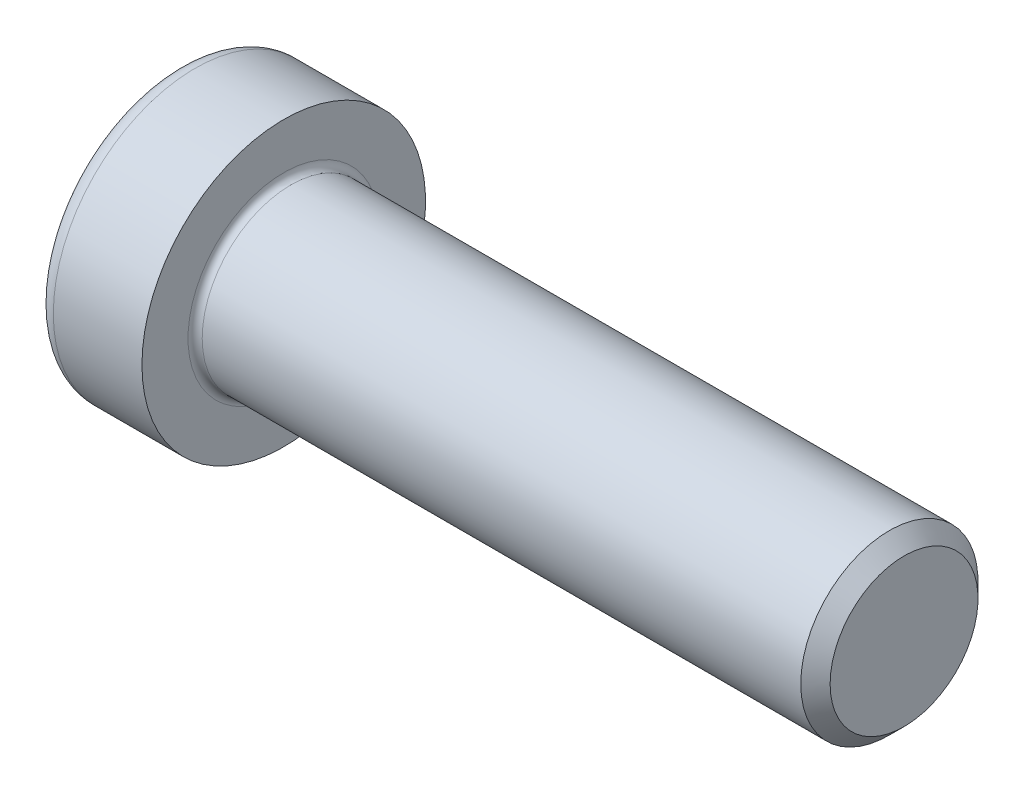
ISO-10303-21;
HEADER;
FILE_DESCRIPTION(('STEP AP214'),'2;1');
FILE_NAME('part.step','',(''),(''),'','','');
FILE_SCHEMA(('AUTOMOTIVE_DESIGN { 1 0 10303 214 1 1 1 1 }'));
ENDSEC;
DATA;
#1=APPLICATION_CONTEXT('core data for automotive mechanical design processes');
#2=APPLICATION_PROTOCOL_DEFINITION('international standard','automotive_design',2000,#1);
#3=PRODUCT_CONTEXT('',#1,'mechanical');
#4=PRODUCT('Part','Part','',(#3));
#5=PRODUCT_RELATED_PRODUCT_CATEGORY('part','',(#4));
#6=PRODUCT_DEFINITION_FORMATION('','',#4);
#7=PRODUCT_DEFINITION_CONTEXT('part definition',#1,'design');
#8=PRODUCT_DEFINITION('design','',#6,#7);
#9=PRODUCT_DEFINITION_SHAPE('','',#8);
#10=(LENGTH_UNIT() NAMED_UNIT(*) SI_UNIT(.MILLI.,.METRE.));
#11=(NAMED_UNIT(*) PLANE_ANGLE_UNIT() SI_UNIT($,.RADIAN.));
#12=(NAMED_UNIT(*) SI_UNIT($,.STERADIAN.) SOLID_ANGLE_UNIT());
#13=UNCERTAINTY_MEASURE_WITH_UNIT(LENGTH_MEASURE(1.E-05),#10,'distance_accuracy_value','');
#14=(GEOMETRIC_REPRESENTATION_CONTEXT(3) GLOBAL_UNCERTAINTY_ASSIGNED_CONTEXT((#13)) GLOBAL_UNIT_ASSIGNED_CONTEXT((#10,
#11,#12)) REPRESENTATION_CONTEXT('',''));
#15=CARTESIAN_POINT('',(0.,0.,0.));
#16=DIRECTION('',(0.,0.,1.));
#17=DIRECTION('',(1.,0.,0.));
#18=AXIS2_PLACEMENT_3D('',#15,#16,#17);
#19=CARTESIAN_POINT('',(0.,0.,0.));
#20=DIRECTION('',(-1.,0.,0.));
#21=DIRECTION('',(0.,0.,1.));
#22=AXIS2_PLACEMENT_3D('',#19,#20,#21);
#23=PLANE('',#22);
#24=DIRECTION('',(0.,-0.499999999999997,0.86602540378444));
#25=VECTOR('',#24,1.);
#26=CARTESIAN_POINT('',(0.,4.04145188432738,0.));
#27=LINE('',#26,#25);
#28=CARTESIAN_POINT('',(0.,4.04145188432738,0.));
#29=VERTEX_POINT('',#28);
#30=CARTESIAN_POINT('',(0.,2.0207259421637,3.49999999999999));
#31=VERTEX_POINT('',#30);
#32=EDGE_CURVE('E257',#29,#31,#27,.T.);
#33=ORIENTED_EDGE('',*,*,#32,.T.);
#34=DIRECTION('',(0.,1.,0.));
#35=VECTOR('',#34,1.);
#36=CARTESIAN_POINT('',(0.,-2.02072594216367,3.5));
#37=LINE('',#36,#35);
#38=CARTESIAN_POINT('',(0.,-2.02072594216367,3.5));
#39=VERTEX_POINT('',#38);
#40=EDGE_CURVE('E129',#39,#31,#37,.T.);
#41=ORIENTED_EDGE('',*,*,#40,.F.);
#42=DIRECTION('',(0.,-0.500000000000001,-0.866025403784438));
#43=VECTOR('',#42,1.);
#44=CARTESIAN_POINT('',(0.,-2.02072594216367,3.5));
#45=LINE('',#44,#43);
#46=CARTESIAN_POINT('',(0.,-4.04145188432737,0.));
#47=VERTEX_POINT('',#46);
#48=EDGE_CURVE('E260',#39,#47,#45,.T.);
#49=ORIENTED_EDGE('',*,*,#48,.T.);
#50=DIRECTION('',(0.,0.499999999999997,-0.86602540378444));
#51=VECTOR('',#50,1.);
#52=CARTESIAN_POINT('',(0.,-4.04145188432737,0.));
#53=LINE('',#52,#51);
#54=CARTESIAN_POINT('',(0.,-2.02072594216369,-3.5));
#55=VERTEX_POINT('',#54);
#56=EDGE_CURVE('E263',#47,#55,#53,.T.);
#57=ORIENTED_EDGE('',*,*,#56,.T.);
#58=DIRECTION('',(0.,-1.,0.));
#59=VECTOR('',#58,1.);
#60=CARTESIAN_POINT('',(0.,2.02072594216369,-3.50000000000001));
#61=LINE('',#60,#59);
#62=CARTESIAN_POINT('',(0.,2.02072594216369,-3.50000000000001));
#63=VERTEX_POINT('',#62);
#64=EDGE_CURVE('E266',#63,#55,#61,.T.);
#65=ORIENTED_EDGE('',*,*,#64,.F.);
#66=DIRECTION('',(0.,-0.500000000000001,-0.866025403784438));
#67=VECTOR('',#66,1.);
#68=CARTESIAN_POINT('',(0.,4.04145188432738,0.));
#69=LINE('',#68,#67);
#70=EDGE_CURVE('E124',#29,#63,#69,.T.);
#71=ORIENTED_EDGE('',*,*,#70,.F.);
#72=EDGE_LOOP('',(#33,#41,#49,#57,#65,#71));
#73=FACE_BOUND('',#72,.T.);
#74=CARTESIAN_POINT('',(0.,0.,0.));
#75=DIRECTION('',(-1.,0.,0.));
#76=DIRECTION('',(0.,0.,1.));
#77=AXIS2_PLACEMENT_3D('',#74,#75,#76);
#78=CIRCLE('',#77,7.);
#79=CARTESIAN_POINT('',(0.,0.,7.));
#80=VERTEX_POINT('',#79);
#81=EDGE_CURVE('E41',#80,#80,#78,.T.);
#82=ORIENTED_EDGE('',*,*,#81,.T.);
#83=EDGE_LOOP('',(#82));
#84=FACE_BOUND('',#83,.T.);
#85=ADVANCED_FACE('F33',(#73,#84),#23,.T.);
#86=CARTESIAN_POINT('',(-31.75,0.,0.));
#87=DIRECTION('',(-1.,0.,0.));
#88=DIRECTION('',(0.,0.,1.));
#89=AXIS2_PLACEMENT_3D('',#86,#87,#88);
#90=CYLINDRICAL_SURFACE('',#89,8.);
#91=CARTESIAN_POINT('',(1.,0.,0.));
#92=DIRECTION('',(-1.,0.,0.));
#93=DIRECTION('',(0.,0.,1.));
#94=AXIS2_PLACEMENT_3D('',#91,#92,#93);
#95=CIRCLE('',#94,8.);
#96=CARTESIAN_POINT('',(1.,0.,8.));
#97=VERTEX_POINT('',#96);
#98=EDGE_CURVE('E11',#97,#97,#95,.F.);
#99=ORIENTED_EDGE('',*,*,#98,.T.);
#100=EDGE_LOOP('',(#99));
#101=FACE_BOUND('',#100,.T.);
#102=CARTESIAN_POINT('',(6.,0.,0.));
#103=DIRECTION('',(-1.,0.,0.));
#104=DIRECTION('',(0.,0.,1.));
#105=AXIS2_PLACEMENT_3D('',#102,#103,#104);
#106=CIRCLE('',#105,8.);
#107=CARTESIAN_POINT('',(6.,0.,8.));
#108=VERTEX_POINT('',#107);
#109=EDGE_CURVE('E147',#108,#108,#106,.T.);
#110=ORIENTED_EDGE('',*,*,#109,.T.);
#111=EDGE_LOOP('',(#110));
#112=FACE_BOUND('',#111,.T.);
#113=ADVANCED_FACE('F171',(#101,#112),#90,.T.);
#114=CARTESIAN_POINT('',(6.,8.,0.));
#115=DIRECTION('',(1.,0.,0.));
#116=DIRECTION('',(0.,0.,-1.));
#117=AXIS2_PLACEMENT_3D('',#114,#115,#116);
#118=PLANE('',#117);
#119=CARTESIAN_POINT('',(6.,0.,0.));
#120=DIRECTION('',(1.,0.,0.));
#121=DIRECTION('',(0.,0.,-1.));
#122=AXIS2_PLACEMENT_3D('',#119,#120,#121);
#123=CIRCLE('',#122,5.4);
#124=CARTESIAN_POINT('',(6.,0.,-5.4));
#125=VERTEX_POINT('',#124);
#126=EDGE_CURVE('E150',#125,#125,#123,.F.);
#127=ORIENTED_EDGE('',*,*,#126,.T.);
#128=EDGE_LOOP('',(#127));
#129=FACE_BOUND('',#128,.T.);
#130=ORIENTED_EDGE('',*,*,#109,.F.);
#131=EDGE_LOOP('',(#130));
#132=FACE_BOUND('',#131,.T.);
#133=ADVANCED_FACE('F177',(#129,#132),#118,.T.);
#134=CARTESIAN_POINT('',(-31.75,0.,0.));
#135=DIRECTION('',(-1.,0.,0.));
#136=DIRECTION('',(0.,0.,1.));
#137=AXIS2_PLACEMENT_3D('',#134,#135,#136);
#138=CYLINDRICAL_SURFACE('',#137,5.);
#139=CARTESIAN_POINT('',(6.4,0.,0.));
#140=DIRECTION('',(1.,0.,0.));
#141=DIRECTION('',(0.,0.,-1.));
#142=AXIS2_PLACEMENT_3D('',#139,#140,#141);
#143=CIRCLE('',#142,5.);
#144=CARTESIAN_POINT('',(6.4,0.,-5.));
#145=VERTEX_POINT('',#144);
#146=EDGE_CURVE('E153',#145,#145,#143,.T.);
#147=ORIENTED_EDGE('',*,*,#146,.T.);
#148=EDGE_LOOP('',(#147));
#149=FACE_BOUND('',#148,.T.);
#150=CARTESIAN_POINT('',(40.1719999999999,0.,0.));
#151=DIRECTION('',(-1.,0.,0.));
#152=DIRECTION('',(0.,0.,1.));
#153=AXIS2_PLACEMENT_3D('',#150,#151,#152);
#154=CIRCLE('',#153,5.);
#155=CARTESIAN_POINT('',(40.1719999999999,0.,5.));
#156=VERTEX_POINT('',#155);
#157=EDGE_CURVE('E144',#156,#156,#154,.T.);
#158=ORIENTED_EDGE('',*,*,#157,.T.);
#159=EDGE_LOOP('',(#158));
#160=FACE_BOUND('',#159,.T.);
#161=ADVANCED_FACE('F183',(#149,#160),#138,.T.);
#162=CARTESIAN_POINT('',(41.,0.,0.));
#163=DIRECTION('',(-1.,0.,0.));
#164=DIRECTION('',(0.,0.,1.));
#165=AXIS2_PLACEMENT_3D('',#162,#163,#164);
#166=CONICAL_SURFACE('',#165,4.172,0.785398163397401);
#167=ORIENTED_EDGE('',*,*,#157,.F.);
#168=EDGE_LOOP('',(#167));
#169=FACE_BOUND('',#168,.T.);
#170=CARTESIAN_POINT('',(41.,0.,0.));
#171=DIRECTION('',(-1.,0.,0.));
#172=DIRECTION('',(0.,0.,1.));
#173=AXIS2_PLACEMENT_3D('',#170,#171,#172);
#174=CIRCLE('',#173,4.172);
#175=CARTESIAN_POINT('',(41.,0.,4.172));
#176=VERTEX_POINT('',#175);
#177=EDGE_CURVE('E140',#176,#176,#174,.T.);
#178=ORIENTED_EDGE('',*,*,#177,.T.);
#179=EDGE_LOOP('',(#178));
#180=FACE_BOUND('',#179,.T.);
#181=ADVANCED_FACE('F187',(#169,#180),#166,.T.);
#182=CARTESIAN_POINT('',(41.,4.172,0.));
#183=DIRECTION('',(1.,0.,0.));
#184=DIRECTION('',(0.,0.,-1.));
#185=AXIS2_PLACEMENT_3D('',#182,#183,#184);
#186=PLANE('',#185);
#187=ORIENTED_EDGE('',*,*,#177,.F.);
#188=EDGE_LOOP('',(#187));
#189=FACE_BOUND('',#188,.T.);
#190=ADVANCED_FACE('F167',(#189),#186,.T.);
#191=CARTESIAN_POINT('',(6.4,0.,0.));
#192=DIRECTION('',(1.,0.,0.));
#193=DIRECTION('',(0.,0.,-1.));
#194=AXIS2_PLACEMENT_3D('',#191,#192,#193);
#195=TOROIDAL_SURFACE('',#194,5.4,0.4);
#196=ORIENTED_EDGE('',*,*,#146,.F.);
#197=EDGE_LOOP('',(#196));
#198=FACE_BOUND('',#197,.T.);
#199=ORIENTED_EDGE('',*,*,#126,.F.);
#200=EDGE_LOOP('',(#199));
#201=FACE_BOUND('',#200,.T.);
#202=ADVANCED_FACE('F160',(#198,#201),#195,.F.);
#203=CARTESIAN_POINT('',(1.,0.,0.));
#204=DIRECTION('',(-1.,0.,0.));
#205=DIRECTION('',(0.,0.,1.));
#206=AXIS2_PLACEMENT_3D('',#203,#204,#205);
#207=TOROIDAL_SURFACE('',#206,7.,1.);
#208=ORIENTED_EDGE('',*,*,#98,.F.);
#209=EDGE_LOOP('',(#208));
#210=FACE_BOUND('',#209,.T.);
#211=ORIENTED_EDGE('',*,*,#81,.F.);
#212=EDGE_LOOP('',(#211));
#213=FACE_BOUND('',#212,.T.);
#214=ADVANCED_FACE('F35',(#210,#213),#207,.T.);
#215=CARTESIAN_POINT('',(4.5,4.04145188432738,0.));
#216=DIRECTION('',(0.,-0.86602540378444,-0.499999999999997));
#217=DIRECTION('',(0.,0.499999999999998,-0.86602540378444));
#218=AXIS2_PLACEMENT_3D('',#215,#216,#217);
#219=PLANE('',#218);
#220=ORIENTED_EDGE('',*,*,#32,.F.);
#221=DIRECTION('',(-1.,0.,0.));
#222=VECTOR('',#221,1.);
#223=CARTESIAN_POINT('',(4.5,4.04145188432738,0.));
#224=LINE('',#223,#222);
#225=CARTESIAN_POINT('',(4.5,4.04145188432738,0.));
#226=VERTEX_POINT('',#225);
#227=EDGE_CURVE('E247',#226,#29,#224,.T.);
#228=ORIENTED_EDGE('',*,*,#227,.F.);
#229=DIRECTION('',(0.,-0.499999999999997,0.86602540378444));
#230=VECTOR('',#229,1.);
#231=CARTESIAN_POINT('',(4.5,4.04145188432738,0.));
#232=LINE('',#231,#230);
#233=CARTESIAN_POINT('',(4.5,3.03108891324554,1.74999999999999));
#234=VERTEX_POINT('',#233);
#235=EDGE_CURVE('E116',#226,#234,#232,.T.);
#236=ORIENTED_EDGE('',*,*,#235,.T.);
#237=CARTESIAN_POINT('',(4.5,2.0207259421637,3.49999999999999));
#238=VERTEX_POINT('',#237);
#239=EDGE_CURVE('E107',#234,#238,#232,.T.);
#240=ORIENTED_EDGE('',*,*,#239,.T.);
#241=DIRECTION('',(-1.,0.,0.));
#242=VECTOR('',#241,1.);
#243=CARTESIAN_POINT('',(4.5,2.0207259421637,3.49999999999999));
#244=LINE('',#243,#242);
#245=EDGE_CURVE('E121',#238,#31,#244,.T.);
#246=ORIENTED_EDGE('',*,*,#245,.T.);
#247=EDGE_LOOP('',(#220,#228,#236,#240,#246));
#248=FACE_BOUND('',#247,.T.);
#249=ADVANCED_FACE('F120',(#248),#219,.T.);
#250=CARTESIAN_POINT('',(4.5,-2.02072594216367,3.5));
#251=DIRECTION('',(0.,0.,1.));
#252=DIRECTION('',(0.,-1.,0.));
#253=AXIS2_PLACEMENT_3D('',#250,#251,#252);
#254=PLANE('',#253);
#255=ORIENTED_EDGE('',*,*,#40,.T.);
#256=ORIENTED_EDGE('',*,*,#245,.F.);
#257=DIRECTION('',(0.,1.,0.));
#258=VECTOR('',#257,1.);
#259=CARTESIAN_POINT('',(4.5,-2.02072594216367,3.5));
#260=LINE('',#259,#258);
#261=CARTESIAN_POINT('',(4.5,0.,3.5));
#262=VERTEX_POINT('',#261);
#263=EDGE_CURVE('E104',#262,#238,#260,.T.);
#264=ORIENTED_EDGE('',*,*,#263,.F.);
#265=CARTESIAN_POINT('',(4.5,-2.02072594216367,3.5));
#266=VERTEX_POINT('',#265);
#267=EDGE_CURVE('E115',#266,#262,#260,.T.);
#268=ORIENTED_EDGE('',*,*,#267,.F.);
#269=DIRECTION('',(-1.,0.,0.));
#270=VECTOR('',#269,1.);
#271=CARTESIAN_POINT('',(4.5,-2.02072594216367,3.5));
#272=LINE('',#271,#270);
#273=EDGE_CURVE('E131',#266,#39,#272,.T.);
#274=ORIENTED_EDGE('',*,*,#273,.T.);
#275=EDGE_LOOP('',(#255,#256,#264,#268,#274));
#276=FACE_BOUND('',#275,.T.);
#277=ADVANCED_FACE('F126',(#276),#254,.F.);
#278=CARTESIAN_POINT('',(4.5,-2.02072594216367,3.5));
#279=DIRECTION('',(0.,0.866025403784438,-0.500000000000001));
#280=DIRECTION('',(0.,0.500000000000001,0.866025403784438));
#281=AXIS2_PLACEMENT_3D('',#278,#279,#280);
#282=PLANE('',#281);
#283=ORIENTED_EDGE('',*,*,#48,.F.);
#284=ORIENTED_EDGE('',*,*,#273,.F.);
#285=DIRECTION('',(0.,-0.500000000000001,-0.866025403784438));
#286=VECTOR('',#285,1.);
#287=CARTESIAN_POINT('',(4.5,-2.02072594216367,3.5));
#288=LINE('',#287,#286);
#289=CARTESIAN_POINT('',(4.5,-3.03108891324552,1.75));
#290=VERTEX_POINT('',#289);
#291=EDGE_CURVE('E286',#266,#290,#288,.T.);
#292=ORIENTED_EDGE('',*,*,#291,.T.);
#293=CARTESIAN_POINT('',(4.5,-4.04145188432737,0.));
#294=VERTEX_POINT('',#293);
#295=EDGE_CURVE('E275',#290,#294,#288,.T.);
#296=ORIENTED_EDGE('',*,*,#295,.T.);
#297=DIRECTION('',(-1.,0.,0.));
#298=VECTOR('',#297,1.);
#299=CARTESIAN_POINT('',(4.5,-4.04145188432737,0.));
#300=LINE('',#299,#298);
#301=EDGE_CURVE('E136',#294,#47,#300,.T.);
#302=ORIENTED_EDGE('',*,*,#301,.T.);
#303=EDGE_LOOP('',(#283,#284,#292,#296,#302));
#304=FACE_BOUND('',#303,.T.);
#305=ADVANCED_FACE('F201',(#304),#282,.T.);
#306=CARTESIAN_POINT('',(4.5,-4.04145188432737,0.));
#307=DIRECTION('',(0.,0.86602540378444,0.499999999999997));
#308=DIRECTION('',(0.,-0.499999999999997,0.86602540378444));
#309=AXIS2_PLACEMENT_3D('',#306,#307,#308);
#310=PLANE('',#309);
#311=ORIENTED_EDGE('',*,*,#56,.F.);
#312=ORIENTED_EDGE('',*,*,#301,.F.);
#313=DIRECTION('',(0.,0.499999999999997,-0.86602540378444));
#314=VECTOR('',#313,1.);
#315=CARTESIAN_POINT('',(4.5,-4.04145188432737,0.));
#316=LINE('',#315,#314);
#317=CARTESIAN_POINT('',(4.5,-3.03108891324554,-1.74999999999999));
#318=VERTEX_POINT('',#317);
#319=EDGE_CURVE('E253',#294,#318,#316,.T.);
#320=ORIENTED_EDGE('',*,*,#319,.T.);
#321=CARTESIAN_POINT('',(4.5,-2.02072594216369,-3.5));
#322=VERTEX_POINT('',#321);
#323=EDGE_CURVE('E285',#318,#322,#316,.T.);
#324=ORIENTED_EDGE('',*,*,#323,.T.);
#325=DIRECTION('',(-1.,0.,0.));
#326=VECTOR('',#325,1.);
#327=CARTESIAN_POINT('',(4.5,-2.02072594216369,-3.5));
#328=LINE('',#327,#326);
#329=EDGE_CURVE('E246',#322,#55,#328,.T.);
#330=ORIENTED_EDGE('',*,*,#329,.T.);
#331=EDGE_LOOP('',(#311,#312,#320,#324,#330));
#332=FACE_BOUND('',#331,.T.);
#333=ADVANCED_FACE('F204',(#332),#310,.T.);
#334=CARTESIAN_POINT('',(4.5,2.02072594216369,-3.50000000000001));
#335=DIRECTION('',(0.,0.,-1.));
#336=DIRECTION('',(0.,1.,0.));
#337=AXIS2_PLACEMENT_3D('',#334,#335,#336);
#338=PLANE('',#337);
#339=ORIENTED_EDGE('',*,*,#64,.T.);
#340=ORIENTED_EDGE('',*,*,#329,.F.);
#341=DIRECTION('',(0.,-1.,0.));
#342=VECTOR('',#341,1.);
#343=CARTESIAN_POINT('',(4.5,2.02072594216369,-3.50000000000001));
#344=LINE('',#343,#342);
#345=CARTESIAN_POINT('',(4.5,0.,-3.5));
#346=VERTEX_POINT('',#345);
#347=EDGE_CURVE('E250',#346,#322,#344,.T.);
#348=ORIENTED_EDGE('',*,*,#347,.F.);
#349=CARTESIAN_POINT('',(4.5,2.02072594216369,-3.50000000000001));
#350=VERTEX_POINT('',#349);
#351=EDGE_CURVE('E48',#350,#346,#344,.T.);
#352=ORIENTED_EDGE('',*,*,#351,.F.);
#353=DIRECTION('',(-1.,0.,0.));
#354=VECTOR('',#353,1.);
#355=CARTESIAN_POINT('',(4.5,2.02072594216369,-3.50000000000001));
#356=LINE('',#355,#354);
#357=EDGE_CURVE('E243',#350,#63,#356,.T.);
#358=ORIENTED_EDGE('',*,*,#357,.T.);
#359=EDGE_LOOP('',(#339,#340,#348,#352,#358));
#360=FACE_BOUND('',#359,.T.);
#361=ADVANCED_FACE('F208',(#360),#338,.F.);
#362=CARTESIAN_POINT('',(4.5,4.04145188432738,0.));
#363=DIRECTION('',(0.,0.866025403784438,-0.500000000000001));
#364=DIRECTION('',(0.,0.500000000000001,0.866025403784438));
#365=AXIS2_PLACEMENT_3D('',#362,#363,#364);
#366=PLANE('',#365);
#367=ORIENTED_EDGE('',*,*,#70,.T.);
#368=ORIENTED_EDGE('',*,*,#357,.F.);
#369=DIRECTION('',(0.,-0.500000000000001,-0.866025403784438));
#370=VECTOR('',#369,1.);
#371=CARTESIAN_POINT('',(4.5,4.04145188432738,0.));
#372=LINE('',#371,#370);
#373=CARTESIAN_POINT('',(4.5,3.03108891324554,-1.75000000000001));
#374=VERTEX_POINT('',#373);
#375=EDGE_CURVE('E233',#374,#350,#372,.T.);
#376=ORIENTED_EDGE('',*,*,#375,.F.);
#377=EDGE_CURVE('E239',#226,#374,#372,.T.);
#378=ORIENTED_EDGE('',*,*,#377,.F.);
#379=ORIENTED_EDGE('',*,*,#227,.T.);
#380=EDGE_LOOP('',(#367,#368,#376,#378,#379));
#381=FACE_BOUND('',#380,.T.);
#382=ADVANCED_FACE('F212',(#381),#366,.F.);
#383=CARTESIAN_POINT('',(4.5,6.06217782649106,-3.50000000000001));
#384=DIRECTION('',(1.,0.,0.));
#385=DIRECTION('',(0.,0.,-1.));
#386=AXIS2_PLACEMENT_3D('',#383,#384,#385);
#387=PLANE('',#386);
#388=ORIENTED_EDGE('',*,*,#347,.T.);
#389=ORIENTED_EDGE('',*,*,#323,.F.);
#390=CARTESIAN_POINT('',(4.5,0.,0.));
#391=DIRECTION('',(-1.,0.,0.));
#392=DIRECTION('',(0.,0.,1.));
#393=AXIS2_PLACEMENT_3D('',#390,#391,#392);
#394=CIRCLE('',#393,3.5);
#395=EDGE_CURVE('E281',#346,#318,#394,.T.);
#396=ORIENTED_EDGE('',*,*,#395,.F.);
#397=EDGE_LOOP('',(#388,#389,#396));
#398=FACE_BOUND('',#397,.T.);
#399=ADVANCED_FACE('F216',(#398),#387,.F.);
#400=ORIENTED_EDGE('',*,*,#319,.F.);
#401=ORIENTED_EDGE('',*,*,#295,.F.);
#402=EDGE_CURVE('E134',#318,#290,#394,.T.);
#403=ORIENTED_EDGE('',*,*,#402,.F.);
#404=EDGE_LOOP('',(#400,#401,#403));
#405=FACE_BOUND('',#404,.T.);
#406=ADVANCED_FACE('F219',(#405),#387,.F.);
#407=ORIENTED_EDGE('',*,*,#291,.F.);
#408=ORIENTED_EDGE('',*,*,#267,.T.);
#409=EDGE_CURVE('E130',#290,#262,#394,.T.);
#410=ORIENTED_EDGE('',*,*,#409,.F.);
#411=EDGE_LOOP('',(#407,#408,#410));
#412=FACE_BOUND('',#411,.T.);
#413=ADVANCED_FACE('F224',(#412),#387,.F.);
#414=ORIENTED_EDGE('',*,*,#263,.T.);
#415=ORIENTED_EDGE('',*,*,#239,.F.);
#416=EDGE_CURVE('E110',#262,#234,#394,.T.);
#417=ORIENTED_EDGE('',*,*,#416,.F.);
#418=EDGE_LOOP('',(#414,#415,#417));
#419=FACE_BOUND('',#418,.T.);
#420=ADVANCED_FACE('F106',(#419),#387,.F.);
#421=ORIENTED_EDGE('',*,*,#235,.F.);
#422=ORIENTED_EDGE('',*,*,#377,.T.);
#423=EDGE_CURVE('E141',#234,#374,#394,.T.);
#424=ORIENTED_EDGE('',*,*,#423,.F.);
#425=EDGE_LOOP('',(#421,#422,#424));
#426=FACE_BOUND('',#425,.T.);
#427=ADVANCED_FACE('F227',(#426),#387,.F.);
#428=ORIENTED_EDGE('',*,*,#375,.T.);
#429=ORIENTED_EDGE('',*,*,#351,.T.);
#430=EDGE_CURVE('E236',#374,#346,#394,.T.);
#431=ORIENTED_EDGE('',*,*,#430,.F.);
#432=EDGE_LOOP('',(#428,#429,#431));
#433=FACE_BOUND('',#432,.T.);
#434=ADVANCED_FACE('F197',(#433),#387,.F.);
#435=CARTESIAN_POINT('',(4.5,0.,0.));
#436=DIRECTION('',(-1.,0.,0.));
#437=DIRECTION('',(0.,0.,1.));
#438=AXIS2_PLACEMENT_3D('',#435,#436,#437);
#439=CONICAL_SURFACE('',#438,3.5,1.04719755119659);
#440=CARTESIAN_POINT('',(6.52072594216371,0.,0.));
#441=VERTEX_POINT('',#440);
#442=VERTEX_LOOP('',#441);
#443=FACE_BOUND('',#442,.T.);
#444=ORIENTED_EDGE('',*,*,#416,.T.);
#445=ORIENTED_EDGE('',*,*,#423,.T.);
#446=ORIENTED_EDGE('',*,*,#430,.T.);
#447=ORIENTED_EDGE('',*,*,#395,.T.);
#448=ORIENTED_EDGE('',*,*,#402,.T.);
#449=ORIENTED_EDGE('',*,*,#409,.T.);
#450=EDGE_LOOP('',(#444,#445,#446,#447,#448,#449));
#451=FACE_BOUND('',#450,.T.);
#452=ADVANCED_FACE('F195',(#443,#451),#439,.F.);
#453=CLOSED_SHELL('',(#85,#113,#133,#161,#181,#190,#202,#214,#249,#277,#305,#333,#361,#382,#399,
#406,#413,#420,#427,#434,#452));
#454=MANIFOLD_SOLID_BREP('B2',#453);
#455=ADVANCED_BREP_SHAPE_REPRESENTATION('',(#18,#454),#14);
#456=SHAPE_DEFINITION_REPRESENTATION(#9,#455);
ENDSEC;
END-ISO-10303-21;
